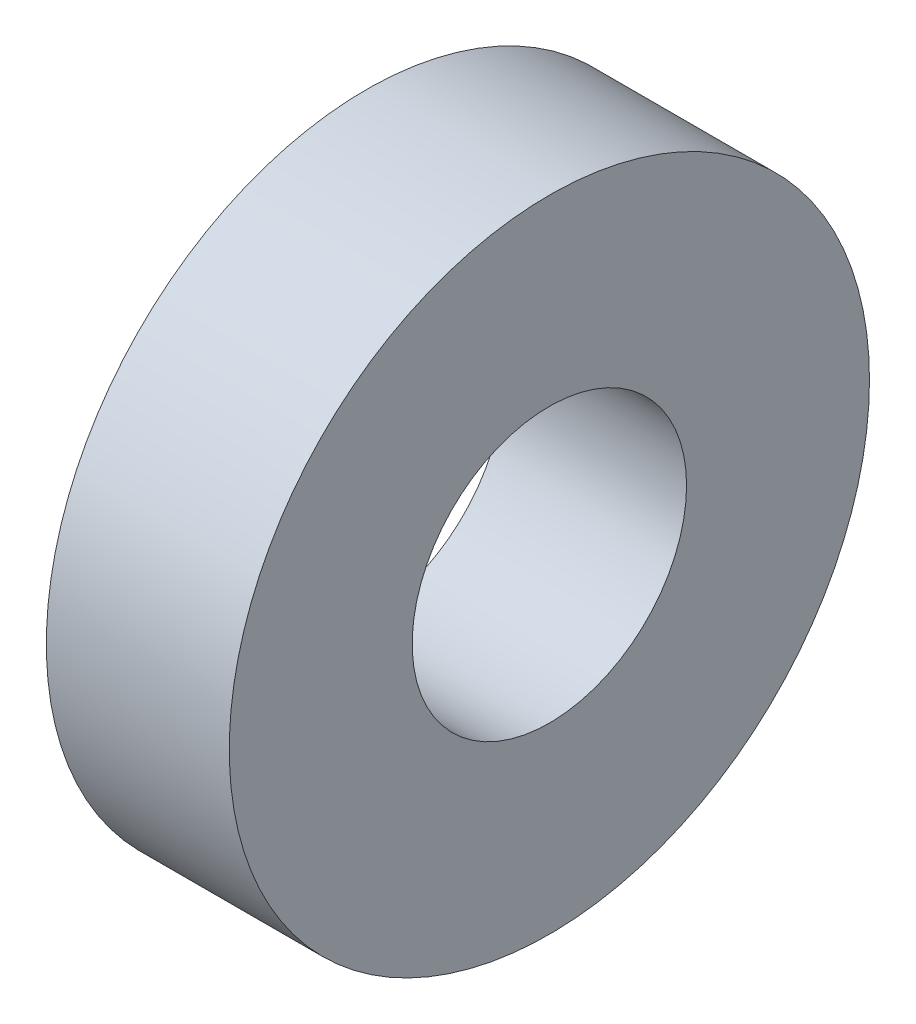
ISO-10303-21;
HEADER;
FILE_DESCRIPTION(('STEP AP214'),'2;1');
FILE_NAME('part.step','',(''),(''),'','','');
FILE_SCHEMA(('AUTOMOTIVE_DESIGN { 1 0 10303 214 1 1 1 1 }'));
ENDSEC;
DATA;
#1=APPLICATION_CONTEXT('core data for automotive mechanical design processes');
#2=APPLICATION_PROTOCOL_DEFINITION('international standard','automotive_design',2000,#1);
#3=PRODUCT_CONTEXT('',#1,'mechanical');
#4=PRODUCT('Part','Part','',(#3));
#5=PRODUCT_RELATED_PRODUCT_CATEGORY('part','',(#4));
#6=PRODUCT_DEFINITION_FORMATION('','',#4);
#7=PRODUCT_DEFINITION_CONTEXT('part definition',#1,'design');
#8=PRODUCT_DEFINITION('design','',#6,#7);
#9=PRODUCT_DEFINITION_SHAPE('','',#8);
#10=(LENGTH_UNIT() NAMED_UNIT(*) SI_UNIT(.MILLI.,.METRE.));
#11=(NAMED_UNIT(*) PLANE_ANGLE_UNIT() SI_UNIT($,.RADIAN.));
#12=(NAMED_UNIT(*) SI_UNIT($,.STERADIAN.) SOLID_ANGLE_UNIT());
#13=UNCERTAINTY_MEASURE_WITH_UNIT(LENGTH_MEASURE(1.E-05),#10,'distance_accuracy_value','');
#14=(GEOMETRIC_REPRESENTATION_CONTEXT(3) GLOBAL_UNCERTAINTY_ASSIGNED_CONTEXT((#13)) GLOBAL_UNIT_ASSIGNED_CONTEXT((#10,
#11,#12)) REPRESENTATION_CONTEXT('',''));
#15=CARTESIAN_POINT('',(0.,0.,0.));
#16=DIRECTION('',(0.,0.,1.));
#17=DIRECTION('',(1.,0.,0.));
#18=AXIS2_PLACEMENT_3D('',#15,#16,#17);
#19=CARTESIAN_POINT('',(1.,0.,0.));
#20=DIRECTION('',(1.,0.,0.));
#21=DIRECTION('',(0.,0.,-1.));
#22=AXIS2_PLACEMENT_3D('',#19,#20,#21);
#23=PLANE('',#22);
#24=CARTESIAN_POINT('',(1.,0.,0.));
#25=DIRECTION('',(1.,0.,0.));
#26=DIRECTION('',(0.,0.,-1.));
#27=AXIS2_PLACEMENT_3D('',#24,#25,#26);
#28=CIRCLE('',#27,3.5);
#29=CARTESIAN_POINT('',(1.,0.,-3.5));
#30=VERTEX_POINT('',#29);
#31=EDGE_CURVE('E10',#30,#30,#28,.T.);
#32=ORIENTED_EDGE('',*,*,#31,.T.);
#33=EDGE_LOOP('',(#32));
#34=FACE_BOUND('',#33,.T.);
#35=CARTESIAN_POINT('',(1.,0.,0.));
#36=DIRECTION('',(1.,0.,0.));
#37=DIRECTION('',(0.,0.,-1.));
#38=AXIS2_PLACEMENT_3D('',#35,#36,#37);
#39=CIRCLE('',#38,1.5);
#40=CARTESIAN_POINT('',(1.,0.,-1.5));
#41=VERTEX_POINT('',#40);
#42=EDGE_CURVE('E48',#41,#41,#39,.T.);
#43=ORIENTED_EDGE('',*,*,#42,.F.);
#44=EDGE_LOOP('',(#43));
#45=FACE_BOUND('',#44,.T.);
#46=ADVANCED_FACE('F37',(#34,#45),#23,.T.);
#47=CARTESIAN_POINT('',(-1.,0.,0.));
#48=DIRECTION('',(1.,0.,0.));
#49=DIRECTION('',(0.,0.,-1.));
#50=AXIS2_PLACEMENT_3D('',#47,#48,#49);
#51=PLANE('',#50);
#52=CARTESIAN_POINT('',(-1.,0.,0.));
#53=DIRECTION('',(1.,0.,0.));
#54=DIRECTION('',(0.,0.,-1.));
#55=AXIS2_PLACEMENT_3D('',#52,#53,#54);
#56=CIRCLE('',#55,3.5);
#57=CARTESIAN_POINT('',(-1.,0.,-3.5));
#58=VERTEX_POINT('',#57);
#59=EDGE_CURVE('E41',#58,#58,#56,.T.);
#60=ORIENTED_EDGE('',*,*,#59,.F.);
#61=EDGE_LOOP('',(#60));
#62=FACE_BOUND('',#61,.T.);
#63=CARTESIAN_POINT('',(-1.,0.,0.));
#64=DIRECTION('',(1.,0.,0.));
#65=DIRECTION('',(0.,0.,-1.));
#66=AXIS2_PLACEMENT_3D('',#63,#64,#65);
#67=CIRCLE('',#66,1.5);
#68=CARTESIAN_POINT('',(-1.,0.,-1.5));
#69=VERTEX_POINT('',#68);
#70=EDGE_CURVE('E50',#69,#69,#67,.T.);
#71=ORIENTED_EDGE('',*,*,#70,.T.);
#72=EDGE_LOOP('',(#71));
#73=FACE_BOUND('',#72,.T.);
#74=ADVANCED_FACE('F60',(#62,#73),#51,.F.);
#75=CARTESIAN_POINT('',(1.,0.,0.));
#76=DIRECTION('',(-1.,0.,0.));
#77=DIRECTION('',(0.,0.,1.));
#78=AXIS2_PLACEMENT_3D('',#75,#76,#77);
#79=CYLINDRICAL_SURFACE('',#78,3.5);
#80=ORIENTED_EDGE('',*,*,#31,.F.);
#81=EDGE_LOOP('',(#80));
#82=FACE_BOUND('',#81,.T.);
#83=ORIENTED_EDGE('',*,*,#59,.T.);
#84=EDGE_LOOP('',(#83));
#85=FACE_BOUND('',#84,.T.);
#86=ADVANCED_FACE('F39',(#82,#85),#79,.T.);
#87=CARTESIAN_POINT('',(1.,0.,0.));
#88=DIRECTION('',(-1.,0.,0.));
#89=DIRECTION('',(0.,0.,1.));
#90=AXIS2_PLACEMENT_3D('',#87,#88,#89);
#91=CYLINDRICAL_SURFACE('',#90,1.5);
#92=ORIENTED_EDGE('',*,*,#42,.T.);
#93=EDGE_LOOP('',(#92));
#94=FACE_BOUND('',#93,.T.);
#95=ORIENTED_EDGE('',*,*,#70,.F.);
#96=EDGE_LOOP('',(#95));
#97=FACE_BOUND('',#96,.T.);
#98=ADVANCED_FACE('F56',(#94,#97),#91,.F.);
#99=CLOSED_SHELL('',(#46,#74,#86,#98));
#100=MANIFOLD_SOLID_BREP('B2',#99);
#101=ADVANCED_BREP_SHAPE_REPRESENTATION('',(#18,#100),#14);
#102=SHAPE_DEFINITION_REPRESENTATION(#9,#101);
ENDSEC;
END-ISO-10303-21;
